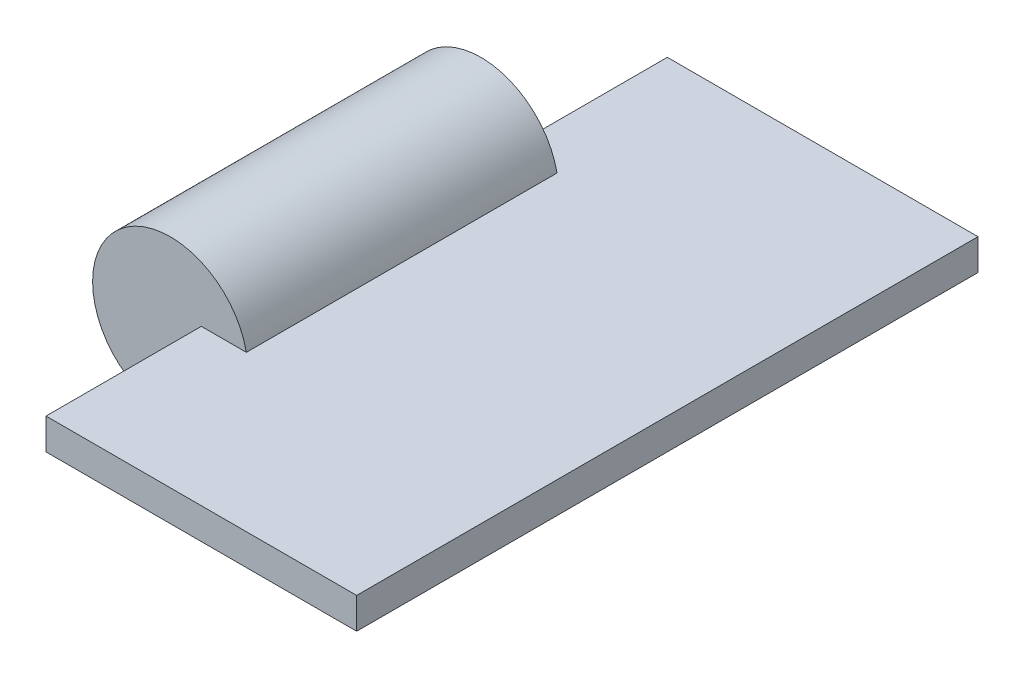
ISO-10303-21;
HEADER;
FILE_DESCRIPTION(('STEP AP214'),'2;1');
FILE_NAME('part.step','',(''),(''),'','','');
FILE_SCHEMA(('AUTOMOTIVE_DESIGN { 1 0 10303 214 1 1 1 1 }'));
ENDSEC;
DATA;
#1=APPLICATION_CONTEXT('core data for automotive mechanical design processes');
#2=APPLICATION_PROTOCOL_DEFINITION('international standard','automotive_design',2000,#1);
#3=PRODUCT_CONTEXT('',#1,'mechanical');
#4=PRODUCT('Part','Part','',(#3));
#5=PRODUCT_RELATED_PRODUCT_CATEGORY('part','',(#4));
#6=PRODUCT_DEFINITION_FORMATION('','',#4);
#7=PRODUCT_DEFINITION_CONTEXT('part definition',#1,'design');
#8=PRODUCT_DEFINITION('design','',#6,#7);
#9=PRODUCT_DEFINITION_SHAPE('','',#8);
#10=(LENGTH_UNIT() NAMED_UNIT(*) SI_UNIT(.MILLI.,.METRE.));
#11=(NAMED_UNIT(*) PLANE_ANGLE_UNIT() SI_UNIT($,.RADIAN.));
#12=(NAMED_UNIT(*) SI_UNIT($,.STERADIAN.) SOLID_ANGLE_UNIT());
#13=UNCERTAINTY_MEASURE_WITH_UNIT(LENGTH_MEASURE(1.E-05),#10,'distance_accuracy_value','');
#14=(GEOMETRIC_REPRESENTATION_CONTEXT(3) GLOBAL_UNCERTAINTY_ASSIGNED_CONTEXT((#13)) GLOBAL_UNIT_ASSIGNED_CONTEXT((#10,
#11,#12)) REPRESENTATION_CONTEXT('',''));
#15=CARTESIAN_POINT('',(0.,0.,0.));
#16=DIRECTION('',(0.,0.,1.));
#17=DIRECTION('',(1.,0.,0.));
#18=AXIS2_PLACEMENT_3D('',#15,#16,#17);
#19=CARTESIAN_POINT('',(2.,1.,-10.));
#20=DIRECTION('',(1.,0.,0.));
#21=DIRECTION('',(0.,0.,-1.));
#22=AXIS2_PLACEMENT_3D('',#19,#20,#21);
#23=PLANE('',#22);
#24=DIRECTION('',(0.,0.,1.));
#25=VECTOR('',#24,1.);
#26=CARTESIAN_POINT('',(2.,-1.,-10.));
#27=LINE('',#26,#25);
#28=CARTESIAN_POINT('',(2.,-1.,-10.));
#29=VERTEX_POINT('',#28);
#30=CARTESIAN_POINT('',(2.,-1.,0.));
#31=VERTEX_POINT('',#30);
#32=EDGE_CURVE('E164',#29,#31,#27,.T.);
#33=ORIENTED_EDGE('',*,*,#32,.T.);
#34=DIRECTION('',(0.,1.,0.));
#35=VECTOR('',#34,1.);
#36=CARTESIAN_POINT('',(2.,0.,0.));
#37=LINE('',#36,#35);
#38=CARTESIAN_POINT('',(2.,1.,0.));
#39=VERTEX_POINT('',#38);
#40=EDGE_CURVE('E41',#31,#39,#37,.T.);
#41=ORIENTED_EDGE('',*,*,#40,.T.);
#42=DIRECTION('',(0.,0.,1.));
#43=VECTOR('',#42,1.);
#44=CARTESIAN_POINT('',(2.,1.,-10.));
#45=LINE('',#44,#43);
#46=CARTESIAN_POINT('',(2.,1.,-10.));
#47=VERTEX_POINT('',#46);
#48=EDGE_CURVE('E97',#47,#39,#45,.T.);
#49=ORIENTED_EDGE('',*,*,#48,.F.);
#50=DIRECTION('',(0.,-1.,0.));
#51=VECTOR('',#50,1.);
#52=CARTESIAN_POINT('',(2.,1.,-10.));
#53=LINE('',#52,#51);
#54=EDGE_CURVE('E101',#47,#29,#53,.T.);
#55=ORIENTED_EDGE('',*,*,#54,.T.);
#56=EDGE_LOOP('',(#33,#41,#49,#55));
#57=FACE_BOUND('',#56,.T.);
#58=ADVANCED_FACE('F33',(#57),#23,.F.);
#59=CARTESIAN_POINT('',(2.,1.,-10.));
#60=DIRECTION('',(0.,0.,1.));
#61=DIRECTION('',(1.,0.,0.));
#62=AXIS2_PLACEMENT_3D('',#59,#60,#61);
#63=PLANE('',#62);
#64=DIRECTION('',(-1.,0.,0.));
#65=VECTOR('',#64,1.);
#66=CARTESIAN_POINT('',(2.,-1.,-10.));
#67=LINE('',#66,#65);
#68=CARTESIAN_POINT('',(22.,-1.,-10.));
#69=VERTEX_POINT('',#68);
#70=EDGE_CURVE('E120',#69,#29,#67,.T.);
#71=ORIENTED_EDGE('',*,*,#70,.T.);
#72=ORIENTED_EDGE('',*,*,#54,.F.);
#73=DIRECTION('',(-1.,0.,0.));
#74=VECTOR('',#73,1.);
#75=CARTESIAN_POINT('',(2.,1.,-10.));
#76=LINE('',#75,#74);
#77=CARTESIAN_POINT('',(22.,1.,-10.));
#78=VERTEX_POINT('',#77);
#79=EDGE_CURVE('E109',#78,#47,#76,.T.);
#80=ORIENTED_EDGE('',*,*,#79,.F.);
#81=DIRECTION('',(0.,-1.,0.));
#82=VECTOR('',#81,1.);
#83=CARTESIAN_POINT('',(22.,1.,-10.));
#84=LINE('',#83,#82);
#85=EDGE_CURVE('E161',#78,#69,#84,.T.);
#86=ORIENTED_EDGE('',*,*,#85,.T.);
#87=EDGE_LOOP('',(#71,#72,#80,#86));
#88=FACE_BOUND('',#87,.T.);
#89=ADVANCED_FACE('F118',(#88),#63,.F.);
#90=DIRECTION('',(0.,1.,0.));
#91=VECTOR('',#90,1.);
#92=CARTESIAN_POINT('',(2.,0.,20.));
#93=LINE('',#92,#91);
#94=CARTESIAN_POINT('',(2.,-1.,20.));
#95=VERTEX_POINT('',#94);
#96=CARTESIAN_POINT('',(2.,1.,20.));
#97=VERTEX_POINT('',#96);
#98=EDGE_CURVE('E134',#95,#97,#93,.T.);
#99=ORIENTED_EDGE('',*,*,#98,.F.);
#100=CARTESIAN_POINT('',(2.00000000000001,-1.,30.));
#101=VERTEX_POINT('',#100);
#102=EDGE_CURVE('E163',#95,#101,#27,.T.);
#103=ORIENTED_EDGE('',*,*,#102,.T.);
#104=DIRECTION('',(0.,-1.,0.));
#105=VECTOR('',#104,1.);
#106=CARTESIAN_POINT('',(2.00000000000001,1.,30.));
#107=LINE('',#106,#105);
#108=CARTESIAN_POINT('',(2.00000000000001,1.,30.));
#109=VERTEX_POINT('',#108);
#110=EDGE_CURVE('E121',#109,#101,#107,.T.);
#111=ORIENTED_EDGE('',*,*,#110,.F.);
#112=EDGE_CURVE('E106',#97,#109,#45,.T.);
#113=ORIENTED_EDGE('',*,*,#112,.F.);
#114=EDGE_LOOP('',(#99,#103,#111,#113));
#115=FACE_BOUND('',#114,.T.);
#116=ADVANCED_FACE('F155',(#115),#23,.F.);
#117=CARTESIAN_POINT('',(22.,1.,30.));
#118=DIRECTION('',(0.,0.,-1.));
#119=DIRECTION('',(-1.,0.,0.));
#120=AXIS2_PLACEMENT_3D('',#117,#118,#119);
#121=PLANE('',#120);
#122=DIRECTION('',(1.,0.,0.));
#123=VECTOR('',#122,1.);
#124=CARTESIAN_POINT('',(22.,-1.,30.));
#125=LINE('',#124,#123);
#126=CARTESIAN_POINT('',(22.,-1.,30.));
#127=VERTEX_POINT('',#126);
#128=EDGE_CURVE('E166',#101,#127,#125,.T.);
#129=ORIENTED_EDGE('',*,*,#128,.T.);
#130=DIRECTION('',(0.,-1.,0.));
#131=VECTOR('',#130,1.);
#132=CARTESIAN_POINT('',(22.,1.,30.));
#133=LINE('',#132,#131);
#134=CARTESIAN_POINT('',(22.,1.,30.));
#135=VERTEX_POINT('',#134);
#136=EDGE_CURVE('E126',#135,#127,#133,.T.);
#137=ORIENTED_EDGE('',*,*,#136,.F.);
#138=DIRECTION('',(1.,0.,0.));
#139=VECTOR('',#138,1.);
#140=CARTESIAN_POINT('',(22.,1.,30.));
#141=LINE('',#140,#139);
#142=EDGE_CURVE('E105',#109,#135,#141,.T.);
#143=ORIENTED_EDGE('',*,*,#142,.F.);
#144=ORIENTED_EDGE('',*,*,#110,.T.);
#145=EDGE_LOOP('',(#129,#137,#143,#144));
#146=FACE_BOUND('',#145,.T.);
#147=ADVANCED_FACE('F177',(#146),#121,.F.);
#148=CARTESIAN_POINT('',(22.,1.,-10.));
#149=DIRECTION('',(-1.,0.,0.));
#150=DIRECTION('',(0.,0.,1.));
#151=AXIS2_PLACEMENT_3D('',#148,#149,#150);
#152=PLANE('',#151);
#153=DIRECTION('',(0.,0.,-1.));
#154=VECTOR('',#153,1.);
#155=CARTESIAN_POINT('',(22.,-1.,-10.));
#156=LINE('',#155,#154);
#157=EDGE_CURVE('E116',#127,#69,#156,.T.);
#158=ORIENTED_EDGE('',*,*,#157,.T.);
#159=ORIENTED_EDGE('',*,*,#85,.F.);
#160=DIRECTION('',(0.,0.,-1.));
#161=VECTOR('',#160,1.);
#162=CARTESIAN_POINT('',(22.,1.,-10.));
#163=LINE('',#162,#161);
#164=EDGE_CURVE('E112',#135,#78,#163,.T.);
#165=ORIENTED_EDGE('',*,*,#164,.F.);
#166=ORIENTED_EDGE('',*,*,#136,.T.);
#167=EDGE_LOOP('',(#158,#159,#165,#166));
#168=FACE_BOUND('',#167,.T.);
#169=ADVANCED_FACE('F173',(#168),#152,.F.);
#170=CARTESIAN_POINT('',(0.,1.,0.));
#171=DIRECTION('',(0.,-1.,0.));
#172=DIRECTION('',(0.,0.,-1.));
#173=AXIS2_PLACEMENT_3D('',#170,#171,#172);
#174=PLANE('',#173);
#175=DIRECTION('',(1.,0.,0.));
#176=VECTOR('',#175,1.);
#177=CARTESIAN_POINT('',(0.,1.,20.));
#178=LINE('',#177,#176);
#179=CARTESIAN_POINT('',(4.89897948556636,1.,20.));
#180=VERTEX_POINT('',#179);
#181=EDGE_CURVE('E132',#97,#180,#178,.T.);
#182=ORIENTED_EDGE('',*,*,#181,.F.);
#183=ORIENTED_EDGE('',*,*,#112,.T.);
#184=ORIENTED_EDGE('',*,*,#142,.T.);
#185=ORIENTED_EDGE('',*,*,#164,.T.);
#186=ORIENTED_EDGE('',*,*,#79,.T.);
#187=ORIENTED_EDGE('',*,*,#48,.T.);
#188=DIRECTION('',(1.,0.,0.));
#189=VECTOR('',#188,1.);
#190=CARTESIAN_POINT('',(0.,1.,0.));
#191=LINE('',#190,#189);
#192=CARTESIAN_POINT('',(4.89897948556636,1.,0.));
#193=VERTEX_POINT('',#192);
#194=EDGE_CURVE('E11',#39,#193,#191,.T.);
#195=ORIENTED_EDGE('',*,*,#194,.T.);
#196=DIRECTION('',(0.,0.,-1.));
#197=VECTOR('',#196,1.);
#198=CARTESIAN_POINT('',(4.89897948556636,1.,20.));
#199=LINE('',#198,#197);
#200=EDGE_CURVE('E55',#193,#180,#199,.F.);
#201=ORIENTED_EDGE('',*,*,#200,.T.);
#202=EDGE_LOOP('',(#182,#183,#184,#185,#186,#187,#195,#201));
#203=FACE_BOUND('',#202,.T.);
#204=ADVANCED_FACE('F110',(#203),#174,.F.);
#205=CARTESIAN_POINT('',(0.,-1.,0.));
#206=DIRECTION('',(0.,-1.,0.));
#207=DIRECTION('',(0.,0.,-1.));
#208=AXIS2_PLACEMENT_3D('',#205,#206,#207);
#209=PLANE('',#208);
#210=ORIENTED_EDGE('',*,*,#102,.F.);
#211=DIRECTION('',(1.,0.,0.));
#212=VECTOR('',#211,1.);
#213=CARTESIAN_POINT('',(0.,-1.,20.));
#214=LINE('',#213,#212);
#215=CARTESIAN_POINT('',(4.89897948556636,-1.,20.));
#216=VERTEX_POINT('',#215);
#217=EDGE_CURVE('E123',#95,#216,#214,.T.);
#218=ORIENTED_EDGE('',*,*,#217,.T.);
#219=DIRECTION('',(0.,0.,-1.));
#220=VECTOR('',#219,1.);
#221=CARTESIAN_POINT('',(4.89897948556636,-1.,20.));
#222=LINE('',#221,#220);
#223=CARTESIAN_POINT('',(4.89897948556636,-1.,0.));
#224=VERTEX_POINT('',#223);
#225=EDGE_CURVE('E48',#224,#216,#222,.F.);
#226=ORIENTED_EDGE('',*,*,#225,.F.);
#227=DIRECTION('',(1.,0.,0.));
#228=VECTOR('',#227,1.);
#229=CARTESIAN_POINT('',(0.,-1.,0.));
#230=LINE('',#229,#228);
#231=EDGE_CURVE('E141',#31,#224,#230,.T.);
#232=ORIENTED_EDGE('',*,*,#231,.F.);
#233=ORIENTED_EDGE('',*,*,#32,.F.);
#234=ORIENTED_EDGE('',*,*,#70,.F.);
#235=ORIENTED_EDGE('',*,*,#157,.F.);
#236=ORIENTED_EDGE('',*,*,#128,.F.);
#237=EDGE_LOOP('',(#210,#218,#226,#232,#233,#234,#235,#236));
#238=FACE_BOUND('',#237,.T.);
#239=ADVANCED_FACE('F176',(#238),#209,.T.);
#240=CARTESIAN_POINT('',(0.,0.,20.));
#241=DIRECTION('',(0.,0.,-1.));
#242=DIRECTION('',(-1.,0.,0.));
#243=AXIS2_PLACEMENT_3D('',#240,#241,#242);
#244=CYLINDRICAL_SURFACE('',#243,5.);
#245=ORIENTED_EDGE('',*,*,#200,.F.);
#246=CARTESIAN_POINT('',(0.,0.,0.));
#247=DIRECTION('',(0.,0.,1.));
#248=DIRECTION('',(1.,0.,0.));
#249=AXIS2_PLACEMENT_3D('',#246,#247,#248);
#250=CIRCLE('',#249,5.);
#251=EDGE_CURVE('E137',#193,#224,#250,.T.);
#252=ORIENTED_EDGE('',*,*,#251,.T.);
#253=ORIENTED_EDGE('',*,*,#225,.T.);
#254=CARTESIAN_POINT('',(0.,0.,20.));
#255=DIRECTION('',(0.,0.,1.));
#256=DIRECTION('',(1.,0.,0.));
#257=AXIS2_PLACEMENT_3D('',#254,#255,#256);
#258=CIRCLE('',#257,5.);
#259=EDGE_CURVE('E138',#180,#216,#258,.T.);
#260=ORIENTED_EDGE('',*,*,#259,.F.);
#261=EDGE_LOOP('',(#245,#252,#253,#260));
#262=FACE_BOUND('',#261,.T.);
#263=ADVANCED_FACE('F35',(#262),#244,.T.);
#264=CARTESIAN_POINT('',(0.,0.,20.));
#265=DIRECTION('',(0.,0.,1.));
#266=DIRECTION('',(1.,0.,0.));
#267=AXIS2_PLACEMENT_3D('',#264,#265,#266);
#268=PLANE('',#267);
#269=ORIENTED_EDGE('',*,*,#98,.T.);
#270=ORIENTED_EDGE('',*,*,#181,.T.);
#271=ORIENTED_EDGE('',*,*,#259,.T.);
#272=ORIENTED_EDGE('',*,*,#217,.F.);
#273=EDGE_LOOP('',(#269,#270,#271,#272));
#274=FACE_BOUND('',#273,.T.);
#275=ADVANCED_FACE('F151',(#274),#268,.T.);
#276=CARTESIAN_POINT('',(0.,0.,0.));
#277=DIRECTION('',(0.,0.,1.));
#278=DIRECTION('',(1.,0.,0.));
#279=AXIS2_PLACEMENT_3D('',#276,#277,#278);
#280=PLANE('',#279);
#281=ORIENTED_EDGE('',*,*,#194,.F.);
#282=ORIENTED_EDGE('',*,*,#40,.F.);
#283=ORIENTED_EDGE('',*,*,#231,.T.);
#284=ORIENTED_EDGE('',*,*,#251,.F.);
#285=EDGE_LOOP('',(#281,#282,#283,#284));
#286=FACE_BOUND('',#285,.T.);
#287=ADVANCED_FACE('F146',(#286),#280,.F.);
#288=CLOSED_SHELL('',(#58,#89,#116,#147,#169,#204,#239,#263,#275,#287));
#289=MANIFOLD_SOLID_BREP('B2',#288);
#290=ADVANCED_BREP_SHAPE_REPRESENTATION('',(#18,#289),#14);
#291=SHAPE_DEFINITION_REPRESENTATION(#9,#290);
ENDSEC;
END-ISO-10303-21;
